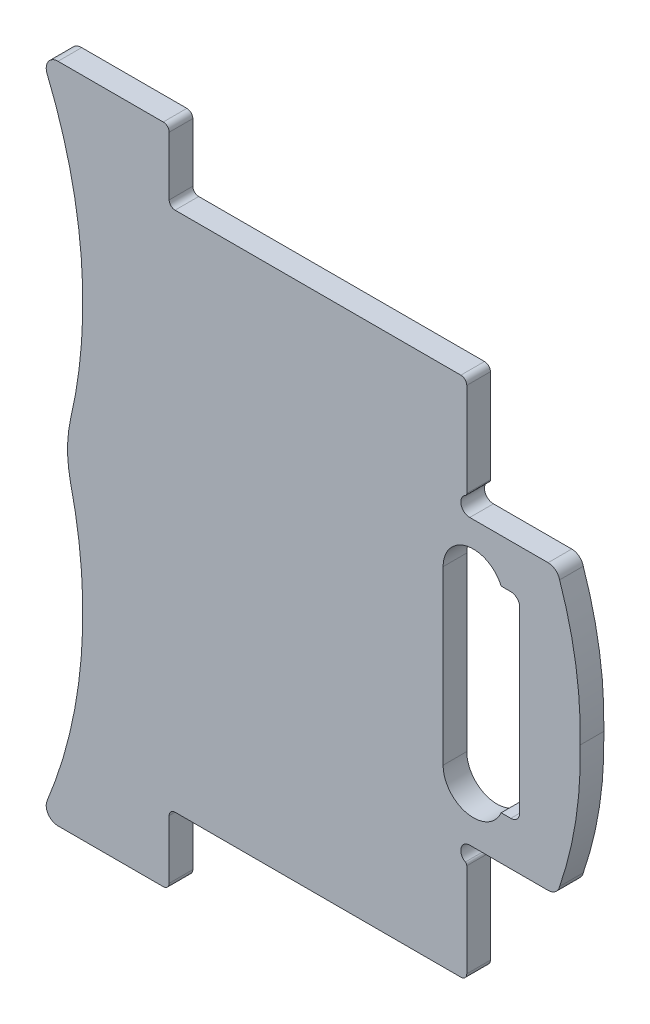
ISO-10303-21;
HEADER;
FILE_DESCRIPTION(('STEP AP214'),'2;1');
FILE_NAME('part.step','',(''),(''),'','','');
FILE_SCHEMA(('AUTOMOTIVE_DESIGN { 1 0 10303 214 1 1 1 1 }'));
ENDSEC;
DATA;
#1=APPLICATION_CONTEXT('core data for automotive mechanical design processes');
#2=APPLICATION_PROTOCOL_DEFINITION('international standard','automotive_design',2000,#1);
#3=PRODUCT_CONTEXT('',#1,'mechanical');
#4=PRODUCT('Part','Part','',(#3));
#5=PRODUCT_RELATED_PRODUCT_CATEGORY('part','',(#4));
#6=PRODUCT_DEFINITION_FORMATION('','',#4);
#7=PRODUCT_DEFINITION_CONTEXT('part definition',#1,'design');
#8=PRODUCT_DEFINITION('design','',#6,#7);
#9=PRODUCT_DEFINITION_SHAPE('','',#8);
#10=(LENGTH_UNIT() NAMED_UNIT(*) SI_UNIT(.MILLI.,.METRE.));
#11=(NAMED_UNIT(*) PLANE_ANGLE_UNIT() SI_UNIT($,.RADIAN.));
#12=(NAMED_UNIT(*) SI_UNIT($,.STERADIAN.) SOLID_ANGLE_UNIT());
#13=UNCERTAINTY_MEASURE_WITH_UNIT(LENGTH_MEASURE(1.E-05),#10,'distance_accuracy_value','');
#14=(GEOMETRIC_REPRESENTATION_CONTEXT(3) GLOBAL_UNCERTAINTY_ASSIGNED_CONTEXT((#13)) GLOBAL_UNIT_ASSIGNED_CONTEXT((#10,
#11,#12)) REPRESENTATION_CONTEXT('',''));
#15=CARTESIAN_POINT('',(0.,0.,0.));
#16=DIRECTION('',(0.,0.,1.));
#17=DIRECTION('',(1.,0.,0.));
#18=AXIS2_PLACEMENT_3D('',#15,#16,#17);
#19=CARTESIAN_POINT('',(109.223647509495,-74.0985462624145,12.7));
#20=DIRECTION('',(0.,0.,1.));
#21=DIRECTION('',(1.,0.,0.));
#22=AXIS2_PLACEMENT_3D('',#19,#20,#21);
#23=CYLINDRICAL_SURFACE('',#22,4.77520001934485);
#24=DIRECTION('',(0.,0.,1.));
#25=VECTOR('',#24,1.);
#26=CARTESIAN_POINT('',(113.99884752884,-74.0985462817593,12.7));
#27=LINE('',#26,#25);
#28=CARTESIAN_POINT('',(113.99884752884,-74.0985462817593,12.7));
#29=VERTEX_POINT('',#28);
#30=CARTESIAN_POINT('',(113.99884752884,-74.0985462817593,25.4));
#31=VERTEX_POINT('',#30);
#32=EDGE_CURVE('E12',#29,#31,#27,.T.);
#33=ORIENTED_EDGE('',*,*,#32,.F.);
#34=CARTESIAN_POINT('',(109.223647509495,-74.0985462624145,12.7));
#35=DIRECTION('',(0.,0.,1.));
#36=DIRECTION('',(-1.,0.,0.));
#37=AXIS2_PLACEMENT_3D('',#34,#35,#36);
#38=CIRCLE('',#37,4.77520001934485);
#39=CARTESIAN_POINT('',(109.223647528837,-78.8737462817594,12.7));
#40=VERTEX_POINT('',#39);
#41=EDGE_CURVE('E595',#40,#29,#38,.T.);
#42=ORIENTED_EDGE('',*,*,#41,.F.);
#43=DIRECTION('',(0.,0.,1.));
#44=VECTOR('',#43,1.);
#45=CARTESIAN_POINT('',(109.223647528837,-78.8737462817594,12.7));
#46=LINE('',#45,#44);
#47=CARTESIAN_POINT('',(109.223647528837,-78.8737462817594,25.4));
#48=VERTEX_POINT('',#47);
#49=EDGE_CURVE('E31',#40,#48,#46,.T.);
#50=ORIENTED_EDGE('',*,*,#49,.T.);
#51=CARTESIAN_POINT('',(109.223647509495,-74.0985462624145,25.4));
#52=DIRECTION('',(0.,0.,1.));
#53=DIRECTION('',(1.,0.,0.));
#54=AXIS2_PLACEMENT_3D('',#51,#52,#53);
#55=CIRCLE('',#54,4.77520001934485);
#56=EDGE_CURVE('E445',#48,#31,#55,.T.);
#57=ORIENTED_EDGE('',*,*,#56,.T.);
#58=EDGE_LOOP('',(#33,#42,#50,#57));
#59=FACE_BOUND('',#58,.T.);
#60=ADVANCED_FACE('F20',(#59),#23,.F.);
#61=CARTESIAN_POINT('',(109.223647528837,-78.8737462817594,12.7));
#62=DIRECTION('',(0.,1.,0.));
#63=DIRECTION('',(1.,0.,0.));
#64=AXIS2_PLACEMENT_3D('',#61,#62,#63);
#65=PLANE('',#64);
#66=ORIENTED_EDGE('',*,*,#49,.F.);
#67=DIRECTION('',(1.,0.,0.));
#68=VECTOR('',#67,1.);
#69=CARTESIAN_POINT('',(109.223647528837,-78.8737462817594,12.7));
#70=LINE('',#69,#68);
#71=CARTESIAN_POINT('',(104.042047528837,-78.8737462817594,12.7));
#72=VERTEX_POINT('',#71);
#73=EDGE_CURVE('E598',#72,#40,#70,.T.);
#74=ORIENTED_EDGE('',*,*,#73,.F.);
#75=DIRECTION('',(0.,0.,1.));
#76=VECTOR('',#75,1.);
#77=CARTESIAN_POINT('',(104.042047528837,-78.8737462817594,12.7));
#78=LINE('',#77,#76);
#79=CARTESIAN_POINT('',(104.042047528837,-78.8737462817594,25.4));
#80=VERTEX_POINT('',#79);
#81=EDGE_CURVE('E742',#72,#80,#78,.T.);
#82=ORIENTED_EDGE('',*,*,#81,.T.);
#83=DIRECTION('',(-1.,0.,0.));
#84=VECTOR('',#83,1.);
#85=CARTESIAN_POINT('',(-374.582985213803,-78.8737462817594,25.4));
#86=LINE('',#85,#84);
#87=EDGE_CURVE('E443',#80,#48,#86,.F.);
#88=ORIENTED_EDGE('',*,*,#87,.T.);
#89=EDGE_LOOP('',(#66,#74,#82,#88));
#90=FACE_BOUND('',#89,.T.);
#91=ADVANCED_FACE('F758',(#90),#65,.T.);
#92=CARTESIAN_POINT('',(89.1364645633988,-72.3911513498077,12.7));
#93=DIRECTION('',(0.,0.,1.));
#94=DIRECTION('',(1.,0.,0.));
#95=AXIS2_PLACEMENT_3D('',#92,#93,#94);
#96=CYLINDRICAL_SURFACE('',#95,16.2542437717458);
#97=ORIENTED_EDGE('',*,*,#81,.F.);
#98=CARTESIAN_POINT('',(89.1364645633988,-72.3911513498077,12.7));
#99=DIRECTION('',(0.,0.,1.));
#100=DIRECTION('',(-1.,0.,0.));
#101=AXIS2_PLACEMENT_3D('',#98,#99,#100);
#102=CIRCLE('',#101,16.2542437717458);
#103=CARTESIAN_POINT('',(72.8823144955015,-72.335959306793,12.7));
#104=VERTEX_POINT('',#103);
#105=EDGE_CURVE('E602',#104,#72,#102,.T.);
#106=ORIENTED_EDGE('',*,*,#105,.F.);
#107=DIRECTION('',(0.,0.,1.));
#108=VECTOR('',#107,1.);
#109=CARTESIAN_POINT('',(72.8823144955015,-72.335959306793,12.7));
#110=LINE('',#109,#108);
#111=CARTESIAN_POINT('',(72.8823144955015,-72.335959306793,25.4));
#112=VERTEX_POINT('',#111);
#113=EDGE_CURVE('E739',#104,#112,#110,.T.);
#114=ORIENTED_EDGE('',*,*,#113,.T.);
#115=CARTESIAN_POINT('',(89.1364645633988,-72.3911513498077,25.4));
#116=DIRECTION('',(0.,0.,1.));
#117=DIRECTION('',(1.,0.,0.));
#118=AXIS2_PLACEMENT_3D('',#115,#116,#117);
#119=CIRCLE('',#118,16.2542437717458);
#120=EDGE_CURVE('E438',#112,#80,#119,.T.);
#121=ORIENTED_EDGE('',*,*,#120,.T.);
#122=EDGE_LOOP('',(#97,#106,#114,#121));
#123=FACE_BOUND('',#122,.T.);
#124=ADVANCED_FACE('F761',(#123),#96,.F.);
#125=CARTESIAN_POINT('',(72.8823144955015,19.9984666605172,12.7));
#126=DIRECTION('',(1.,0.,0.));
#127=DIRECTION('',(0.,-1.,0.));
#128=AXIS2_PLACEMENT_3D('',#125,#126,#127);
#129=PLANE('',#128);
#130=ORIENTED_EDGE('',*,*,#113,.F.);
#131=DIRECTION('',(0.,-1.,0.));
#132=VECTOR('',#131,1.);
#133=CARTESIAN_POINT('',(72.8823144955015,19.9984666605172,12.7));
#134=LINE('',#133,#132);
#135=CARTESIAN_POINT('',(72.8823144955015,19.9984666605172,12.7));
#136=VERTEX_POINT('',#135);
#137=EDGE_CURVE('E606',#136,#104,#134,.T.);
#138=ORIENTED_EDGE('',*,*,#137,.F.);
#139=DIRECTION('',(0.,0.,1.));
#140=VECTOR('',#139,1.);
#141=CARTESIAN_POINT('',(72.8823144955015,19.9984666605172,12.7));
#142=LINE('',#141,#140);
#143=CARTESIAN_POINT('',(72.8823144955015,19.9984666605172,25.4));
#144=VERTEX_POINT('',#143);
#145=EDGE_CURVE('E737',#136,#144,#142,.T.);
#146=ORIENTED_EDGE('',*,*,#145,.T.);
#147=DIRECTION('',(0.,1.,0.));
#148=VECTOR('',#147,1.);
#149=CARTESIAN_POINT('',(72.8823144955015,-98.3607864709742,25.4));
#150=LINE('',#149,#148);
#151=EDGE_CURVE('E442',#144,#112,#150,.F.);
#152=ORIENTED_EDGE('',*,*,#151,.T.);
#153=EDGE_LOOP('',(#130,#138,#146,#152));
#154=FACE_BOUND('',#153,.T.);
#155=ADVANCED_FACE('F767',(#154),#129,.T.);
#156=CARTESIAN_POINT('',(89.1364645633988,20.0536587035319,12.7));
#157=DIRECTION('',(0.,0.,1.));
#158=DIRECTION('',(1.,0.,0.));
#159=AXIS2_PLACEMENT_3D('',#156,#157,#158);
#160=CYLINDRICAL_SURFACE('',#159,16.2542437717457);
#161=ORIENTED_EDGE('',*,*,#145,.F.);
#162=CARTESIAN_POINT('',(89.1364645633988,20.0536587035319,12.7));
#163=DIRECTION('',(0.,0.,1.));
#164=DIRECTION('',(1.,0.,0.));
#165=AXIS2_PLACEMENT_3D('',#162,#163,#164);
#166=CIRCLE('',#165,16.2542437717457);
#167=CARTESIAN_POINT('',(104.042047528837,26.5362536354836,12.7));
#168=VERTEX_POINT('',#167);
#169=EDGE_CURVE('E612',#168,#136,#166,.T.);
#170=ORIENTED_EDGE('',*,*,#169,.F.);
#171=DIRECTION('',(0.,0.,1.));
#172=VECTOR('',#171,1.);
#173=CARTESIAN_POINT('',(104.042047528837,26.5362536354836,12.7));
#174=LINE('',#173,#172);
#175=CARTESIAN_POINT('',(104.042047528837,26.5362536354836,25.4));
#176=VERTEX_POINT('',#175);
#177=EDGE_CURVE('E171',#168,#176,#174,.T.);
#178=ORIENTED_EDGE('',*,*,#177,.T.);
#179=CARTESIAN_POINT('',(89.1364645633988,20.0536587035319,25.4));
#180=DIRECTION('',(0.,0.,1.));
#181=DIRECTION('',(1.,0.,0.));
#182=AXIS2_PLACEMENT_3D('',#179,#180,#181);
#183=CIRCLE('',#182,16.2542437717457);
#184=EDGE_CURVE('E426',#176,#144,#183,.T.);
#185=ORIENTED_EDGE('',*,*,#184,.T.);
#186=EDGE_LOOP('',(#161,#170,#178,#185));
#187=FACE_BOUND('',#186,.T.);
#188=ADVANCED_FACE('F774',(#187),#160,.F.);
#189=CARTESIAN_POINT('',(109.223647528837,26.5362536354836,12.7));
#190=DIRECTION('',(0.,-1.,0.));
#191=DIRECTION('',(-1.,0.,0.));
#192=AXIS2_PLACEMENT_3D('',#189,#190,#191);
#193=PLANE('',#192);
#194=ORIENTED_EDGE('',*,*,#177,.F.);
#195=DIRECTION('',(-1.,0.,0.));
#196=VECTOR('',#195,1.);
#197=CARTESIAN_POINT('',(109.223647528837,26.5362536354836,12.7));
#198=LINE('',#197,#196);
#199=CARTESIAN_POINT('',(109.223647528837,26.5362536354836,12.7));
#200=VERTEX_POINT('',#199);
#201=EDGE_CURVE('E285',#200,#168,#198,.T.);
#202=ORIENTED_EDGE('',*,*,#201,.F.);
#203=DIRECTION('',(0.,0.,1.));
#204=VECTOR('',#203,1.);
#205=CARTESIAN_POINT('',(109.223647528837,26.5362536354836,12.7));
#206=LINE('',#205,#204);
#207=CARTESIAN_POINT('',(109.223647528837,26.5362536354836,25.4));
#208=VERTEX_POINT('',#207);
#209=EDGE_CURVE('E39',#200,#208,#206,.T.);
#210=ORIENTED_EDGE('',*,*,#209,.T.);
#211=DIRECTION('',(-1.,0.,0.));
#212=VECTOR('',#211,1.);
#213=CARTESIAN_POINT('',(-374.582985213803,26.5362536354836,25.4));
#214=LINE('',#213,#212);
#215=EDGE_CURVE('E423',#208,#176,#214,.T.);
#216=ORIENTED_EDGE('',*,*,#215,.T.);
#217=EDGE_LOOP('',(#194,#202,#210,#216));
#218=FACE_BOUND('',#217,.T.);
#219=ADVANCED_FACE('F776',(#218),#193,.T.);
#220=CARTESIAN_POINT('',(109.223647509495,21.7610536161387,12.7));
#221=DIRECTION('',(0.,0.,1.));
#222=DIRECTION('',(1.,0.,0.));
#223=AXIS2_PLACEMENT_3D('',#220,#221,#222);
#224=CYLINDRICAL_SURFACE('',#223,4.77520001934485);
#225=ORIENTED_EDGE('',*,*,#209,.F.);
#226=CARTESIAN_POINT('',(109.223647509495,21.7610536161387,12.7));
#227=DIRECTION('',(0.,0.,1.));
#228=DIRECTION('',(1.,0.,0.));
#229=AXIS2_PLACEMENT_3D('',#226,#227,#228);
#230=CIRCLE('',#229,4.77520001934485);
#231=CARTESIAN_POINT('',(113.99884752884,21.7610536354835,12.7));
#232=VERTEX_POINT('',#231);
#233=EDGE_CURVE('E584',#232,#200,#230,.T.);
#234=ORIENTED_EDGE('',*,*,#233,.F.);
#235=DIRECTION('',(0.,0.,1.));
#236=VECTOR('',#235,1.);
#237=CARTESIAN_POINT('',(113.99884752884,21.7610536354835,12.7));
#238=LINE('',#237,#236);
#239=CARTESIAN_POINT('',(113.99884752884,21.7610536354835,25.4));
#240=VERTEX_POINT('',#239);
#241=EDGE_CURVE('E24',#232,#240,#238,.T.);
#242=ORIENTED_EDGE('',*,*,#241,.T.);
#243=CARTESIAN_POINT('',(109.223647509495,21.7610536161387,25.4));
#244=DIRECTION('',(0.,0.,1.));
#245=DIRECTION('',(1.,0.,0.));
#246=AXIS2_PLACEMENT_3D('',#243,#244,#245);
#247=CIRCLE('',#246,4.77520001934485);
#248=EDGE_CURVE('E293',#240,#208,#247,.T.);
#249=ORIENTED_EDGE('',*,*,#248,.T.);
#250=EDGE_LOOP('',(#225,#234,#242,#249));
#251=FACE_BOUND('',#250,.T.);
#252=ADVANCED_FACE('F778',(#251),#224,.F.);
#253=CARTESIAN_POINT('',(-77.4017349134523,-203.968746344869,12.7));
#254=DIRECTION('',(0.,1.,0.));
#255=DIRECTION('',(1.,0.,0.));
#256=AXIS2_PLACEMENT_3D('',#253,#254,#255);
#257=PLANE('',#256);
#258=DIRECTION('',(0.,0.,1.));
#259=VECTOR('',#258,1.);
#260=CARTESIAN_POINT('',(-133.896948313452,-203.968746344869,12.7));
#261=LINE('',#260,#259);
#262=CARTESIAN_POINT('',(-133.896948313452,-203.968746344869,12.7));
#263=VERTEX_POINT('',#262);
#264=CARTESIAN_POINT('',(-133.896948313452,-203.968746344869,25.4));
#265=VERTEX_POINT('',#264);
#266=EDGE_CURVE('E188',#263,#265,#261,.T.);
#267=ORIENTED_EDGE('',*,*,#266,.F.);
#268=DIRECTION('',(1.,0.,0.));
#269=VECTOR('',#268,1.);
#270=CARTESIAN_POINT('',(-77.4017349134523,-203.968746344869,12.7));
#271=LINE('',#270,#269);
#272=CARTESIAN_POINT('',(-77.4017349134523,-203.968746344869,12.7));
#273=VERTEX_POINT('',#272);
#274=EDGE_CURVE('E457',#263,#273,#271,.T.);
#275=ORIENTED_EDGE('',*,*,#274,.T.);
#276=DIRECTION('',(0.,0.,1.));
#277=VECTOR('',#276,1.);
#278=CARTESIAN_POINT('',(-77.4017349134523,-203.968746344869,12.7));
#279=LINE('',#278,#277);
#280=CARTESIAN_POINT('',(-77.4017349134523,-203.968746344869,25.4));
#281=VERTEX_POINT('',#280);
#282=EDGE_CURVE('E722',#273,#281,#279,.T.);
#283=ORIENTED_EDGE('',*,*,#282,.T.);
#284=DIRECTION('',(-1.,0.,0.));
#285=VECTOR('',#284,1.);
#286=CARTESIAN_POINT('',(-374.582985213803,-203.968746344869,25.4));
#287=LINE('',#286,#285);
#288=EDGE_CURVE('E415',#265,#281,#287,.F.);
#289=ORIENTED_EDGE('',*,*,#288,.F.);
#290=EDGE_LOOP('',(#267,#275,#283,#289));
#291=FACE_BOUND('',#290,.T.);
#292=ADVANCED_FACE('F785',(#291),#257,.F.);
#293=CARTESIAN_POINT('',(-77.4017348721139,-200.793746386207,12.7));
#294=DIRECTION('',(0.,0.,1.));
#295=DIRECTION('',(1.,0.,0.));
#296=AXIS2_PLACEMENT_3D('',#293,#294,#295);
#297=CYLINDRICAL_SURFACE('',#296,3.17499995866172);
#298=ORIENTED_EDGE('',*,*,#282,.F.);
#299=CARTESIAN_POINT('',(-77.4017348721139,-200.793746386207,12.7));
#300=DIRECTION('',(0.,0.,1.));
#301=DIRECTION('',(-1.,0.,0.));
#302=AXIS2_PLACEMENT_3D('',#299,#300,#301);
#303=CIRCLE('',#302,3.17499995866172);
#304=CARTESIAN_POINT('',(-74.2267349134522,-200.793746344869,12.7));
#305=VERTEX_POINT('',#304);
#306=EDGE_CURVE('E465',#273,#305,#303,.T.);
#307=ORIENTED_EDGE('',*,*,#306,.T.);
#308=DIRECTION('',(0.,0.,1.));
#309=VECTOR('',#308,1.);
#310=CARTESIAN_POINT('',(-74.2267349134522,-200.793746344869,12.7));
#311=LINE('',#310,#309);
#312=CARTESIAN_POINT('',(-74.2267349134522,-200.793746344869,25.4));
#313=VERTEX_POINT('',#312);
#314=EDGE_CURVE('E714',#305,#313,#311,.T.);
#315=ORIENTED_EDGE('',*,*,#314,.T.);
#316=CARTESIAN_POINT('',(-77.4017348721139,-200.793746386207,25.4));
#317=DIRECTION('',(0.,0.,1.));
#318=DIRECTION('',(1.,0.,0.));
#319=AXIS2_PLACEMENT_3D('',#316,#317,#318);
#320=CIRCLE('',#319,3.17499995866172);
#321=EDGE_CURVE('E411',#281,#313,#320,.T.);
#322=ORIENTED_EDGE('',*,*,#321,.F.);
#323=EDGE_LOOP('',(#298,#307,#315,#322));
#324=FACE_BOUND('',#323,.T.);
#325=ADVANCED_FACE('F829',(#324),#297,.T.);
#326=CARTESIAN_POINT('',(-74.2267349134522,-169.329496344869,12.7));
#327=DIRECTION('',(-1.,0.,0.));
#328=DIRECTION('',(0.,1.,0.));
#329=AXIS2_PLACEMENT_3D('',#326,#327,#328);
#330=PLANE('',#329);
#331=ORIENTED_EDGE('',*,*,#314,.F.);
#332=DIRECTION('',(0.,1.,0.));
#333=VECTOR('',#332,1.);
#334=CARTESIAN_POINT('',(-74.2267349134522,-169.329496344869,12.7));
#335=LINE('',#334,#333);
#336=CARTESIAN_POINT('',(-74.2267349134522,-169.329496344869,12.7));
#337=VERTEX_POINT('',#336);
#338=EDGE_CURVE('E468',#305,#337,#335,.T.);
#339=ORIENTED_EDGE('',*,*,#338,.T.);
#340=DIRECTION('',(0.,0.,1.));
#341=VECTOR('',#340,1.);
#342=CARTESIAN_POINT('',(-74.2267349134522,-169.329496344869,12.7));
#343=LINE('',#342,#341);
#344=CARTESIAN_POINT('',(-74.2267349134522,-169.329496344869,25.4));
#345=VERTEX_POINT('',#344);
#346=EDGE_CURVE('E711',#337,#345,#343,.T.);
#347=ORIENTED_EDGE('',*,*,#346,.T.);
#348=DIRECTION('',(0.,1.,0.));
#349=VECTOR('',#348,1.);
#350=CARTESIAN_POINT('',(-74.2267349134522,-98.3607864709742,25.4));
#351=LINE('',#350,#349);
#352=EDGE_CURVE('E407',#313,#345,#351,.T.);
#353=ORIENTED_EDGE('',*,*,#352,.F.);
#354=EDGE_LOOP('',(#331,#339,#347,#353));
#355=FACE_BOUND('',#354,.T.);
#356=ADVANCED_FACE('F839',(#355),#330,.F.);
#357=CARTESIAN_POINT('',(-71.0517349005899,-169.329496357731,12.7));
#358=DIRECTION('',(0.,0.,-1.));
#359=DIRECTION('',(-1.,0.,0.));
#360=AXIS2_PLACEMENT_3D('',#357,#358,#359);
#361=CYLINDRICAL_SURFACE('',#360,3.17500001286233);
#362=ORIENTED_EDGE('',*,*,#346,.F.);
#363=CARTESIAN_POINT('',(-71.0517349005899,-169.329496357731,12.7));
#364=DIRECTION('',(0.,0.,-1.));
#365=DIRECTION('',(-1.,0.,0.));
#366=AXIS2_PLACEMENT_3D('',#363,#364,#365);
#367=CIRCLE('',#366,3.17500001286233);
#368=CARTESIAN_POINT('',(-71.0517349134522,-166.154496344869,12.7));
#369=VERTEX_POINT('',#368);
#370=EDGE_CURVE('E472',#337,#369,#367,.T.);
#371=ORIENTED_EDGE('',*,*,#370,.T.);
#372=DIRECTION('',(0.,0.,1.));
#373=VECTOR('',#372,1.);
#374=CARTESIAN_POINT('',(-71.0517349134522,-166.154496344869,12.7));
#375=LINE('',#374,#373);
#376=CARTESIAN_POINT('',(-71.0517349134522,-166.154496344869,25.4));
#377=VERTEX_POINT('',#376);
#378=EDGE_CURVE('E708',#369,#377,#375,.T.);
#379=ORIENTED_EDGE('',*,*,#378,.T.);
#380=CARTESIAN_POINT('',(-71.0517349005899,-169.329496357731,25.4));
#381=DIRECTION('',(0.,0.,-1.));
#382=DIRECTION('',(-1.,0.,0.));
#383=AXIS2_PLACEMENT_3D('',#380,#381,#382);
#384=CIRCLE('',#383,3.17500001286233);
#385=EDGE_CURVE('E403',#345,#377,#384,.T.);
#386=ORIENTED_EDGE('',*,*,#385,.F.);
#387=EDGE_LOOP('',(#362,#371,#379,#386));
#388=FACE_BOUND('',#387,.T.);
#389=ADVANCED_FACE('F849',(#388),#361,.F.);
#390=CARTESIAN_POINT('',(82.4105184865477,-166.154496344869,12.7));
#391=DIRECTION('',(0.,1.,0.));
#392=DIRECTION('',(1.,0.,0.));
#393=AXIS2_PLACEMENT_3D('',#390,#391,#392);
#394=PLANE('',#393);
#395=ORIENTED_EDGE('',*,*,#378,.F.);
#396=DIRECTION('',(1.,0.,0.));
#397=VECTOR('',#396,1.);
#398=CARTESIAN_POINT('',(82.4105184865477,-166.154496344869,12.7));
#399=LINE('',#398,#397);
#400=CARTESIAN_POINT('',(82.4105184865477,-166.154496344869,12.7));
#401=VERTEX_POINT('',#400);
#402=EDGE_CURVE('E476',#369,#401,#399,.T.);
#403=ORIENTED_EDGE('',*,*,#402,.T.);
#404=DIRECTION('',(0.,0.,1.));
#405=VECTOR('',#404,1.);
#406=CARTESIAN_POINT('',(82.4105184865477,-166.154496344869,12.7));
#407=LINE('',#406,#405);
#408=CARTESIAN_POINT('',(82.4105184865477,-166.154496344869,25.4));
#409=VERTEX_POINT('',#408);
#410=EDGE_CURVE('E706',#401,#409,#407,.T.);
#411=ORIENTED_EDGE('',*,*,#410,.T.);
#412=DIRECTION('',(-1.,0.,0.));
#413=VECTOR('',#412,1.);
#414=CARTESIAN_POINT('',(-374.582985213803,-166.154496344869,25.4));
#415=LINE('',#414,#413);
#416=EDGE_CURVE('E406',#377,#409,#415,.F.);
#417=ORIENTED_EDGE('',*,*,#416,.F.);
#418=EDGE_LOOP('',(#395,#403,#411,#417));
#419=FACE_BOUND('',#418,.T.);
#420=ADVANCED_FACE('F859',(#419),#394,.F.);
#421=CARTESIAN_POINT('',(82.4105184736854,-162.979496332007,12.7));
#422=DIRECTION('',(0.,0.,1.));
#423=DIRECTION('',(1.,0.,0.));
#424=AXIS2_PLACEMENT_3D('',#421,#422,#423);
#425=CYLINDRICAL_SURFACE('',#424,3.1750000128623);
#426=ORIENTED_EDGE('',*,*,#410,.F.);
#427=CARTESIAN_POINT('',(82.4105184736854,-162.979496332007,12.7));
#428=DIRECTION('',(0.,0.,1.));
#429=DIRECTION('',(-1.,0.,0.));
#430=AXIS2_PLACEMENT_3D('',#427,#428,#429);
#431=CIRCLE('',#430,3.1750000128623);
#432=CARTESIAN_POINT('',(85.5855184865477,-162.979496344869,12.7));
#433=VERTEX_POINT('',#432);
#434=EDGE_CURVE('E484',#401,#433,#431,.T.);
#435=ORIENTED_EDGE('',*,*,#434,.T.);
#436=DIRECTION('',(0.,0.,1.));
#437=VECTOR('',#436,1.);
#438=CARTESIAN_POINT('',(85.5855184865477,-162.979496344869,12.7));
#439=LINE('',#438,#437);
#440=CARTESIAN_POINT('',(85.5855184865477,-162.979496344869,25.4));
#441=VERTEX_POINT('',#440);
#442=EDGE_CURVE('E698',#433,#441,#439,.T.);
#443=ORIENTED_EDGE('',*,*,#442,.T.);
#444=CARTESIAN_POINT('',(82.4105184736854,-162.979496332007,25.4));
#445=DIRECTION('',(0.,0.,1.));
#446=DIRECTION('',(1.,0.,0.));
#447=AXIS2_PLACEMENT_3D('',#444,#445,#446);
#448=CIRCLE('',#447,3.1750000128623);
#449=EDGE_CURVE('E394',#409,#441,#448,.T.);
#450=ORIENTED_EDGE('',*,*,#449,.F.);
#451=EDGE_LOOP('',(#426,#435,#443,#450));
#452=FACE_BOUND('',#451,.T.);
#453=ADVANCED_FACE('F869',(#452),#425,.T.);
#454=CARTESIAN_POINT('',(85.5854930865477,-112.752672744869,12.7));
#455=DIRECTION('',(-0.999999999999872,-5.0570587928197E-07,0.));
#456=DIRECTION('',(-5.0570587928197E-07,0.999999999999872,0.));
#457=AXIS2_PLACEMENT_3D('',#454,#455,#456);
#458=PLANE('',#457);
#459=ORIENTED_EDGE('',*,*,#442,.F.);
#460=DIRECTION('',(-5.0570587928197E-07,0.999999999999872,0.));
#461=VECTOR('',#460,1.);
#462=CARTESIAN_POINT('',(85.5854930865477,-112.752672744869,12.7));
#463=LINE('',#462,#461);
#464=CARTESIAN_POINT('',(85.5854930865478,-112.752672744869,12.7));
#465=VERTEX_POINT('',#464);
#466=EDGE_CURVE('E487',#433,#465,#463,.T.);
#467=ORIENTED_EDGE('',*,*,#466,.T.);
#468=DIRECTION('',(0.,0.,1.));
#469=VECTOR('',#468,1.);
#470=CARTESIAN_POINT('',(85.5854930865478,-112.752672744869,12.7));
#471=LINE('',#470,#469);
#472=CARTESIAN_POINT('',(85.5854930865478,-112.752672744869,25.4));
#473=VERTEX_POINT('',#472);
#474=EDGE_CURVE('E695',#465,#473,#471,.T.);
#475=ORIENTED_EDGE('',*,*,#474,.T.);
#476=DIRECTION('',(-5.0570587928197E-07,0.999999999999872,0.));
#477=VECTOR('',#476,1.);
#478=CARTESIAN_POINT('',(85.5854930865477,-112.752672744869,25.4));
#479=LINE('',#478,#477);
#480=EDGE_CURVE('E390',#441,#473,#479,.T.);
#481=ORIENTED_EDGE('',*,*,#480,.F.);
#482=EDGE_LOOP('',(#459,#467,#475,#481));
#483=FACE_BOUND('',#482,.T.);
#484=ADVANCED_FACE('F879',(#483),#458,.F.);
#485=CARTESIAN_POINT('',(83.9979835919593,-112.752667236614,12.7));
#486=DIRECTION('',(0.,0.,1.));
#487=DIRECTION('',(1.,0.,0.));
#488=AXIS2_PLACEMENT_3D('',#485,#486,#487);
#489=CYLINDRICAL_SURFACE('',#488,1.58750949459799);
#490=ORIENTED_EDGE('',*,*,#474,.F.);
#491=CARTESIAN_POINT('',(83.9979835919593,-112.752667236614,12.7));
#492=DIRECTION('',(0.,0.,1.));
#493=DIRECTION('',(-1.,0.,0.));
#494=AXIS2_PLACEMENT_3D('',#491,#492,#493);
#495=CIRCLE('',#494,1.58750949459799);
#496=CARTESIAN_POINT('',(84.7901713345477,-111.376940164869,12.7));
#497=VERTEX_POINT('',#496);
#498=EDGE_CURVE('E491',#465,#497,#495,.T.);
#499=ORIENTED_EDGE('',*,*,#498,.T.);
#500=DIRECTION('',(0.,0.,1.));
#501=VECTOR('',#500,1.);
#502=CARTESIAN_POINT('',(84.7901713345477,-111.376940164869,12.7));
#503=LINE('',#502,#501);
#504=CARTESIAN_POINT('',(84.7901713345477,-111.376940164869,25.4));
#505=VERTEX_POINT('',#504);
#506=EDGE_CURVE('E692',#497,#505,#503,.T.);
#507=ORIENTED_EDGE('',*,*,#506,.T.);
#508=CARTESIAN_POINT('',(83.9979835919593,-112.752667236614,25.4));
#509=DIRECTION('',(0.,0.,1.));
#510=DIRECTION('',(1.,0.,0.));
#511=AXIS2_PLACEMENT_3D('',#508,#509,#510);
#512=CIRCLE('',#511,1.58750949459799);
#513=EDGE_CURVE('E386',#473,#505,#512,.T.);
#514=ORIENTED_EDGE('',*,*,#513,.F.);
#515=EDGE_LOOP('',(#490,#499,#507,#514));
#516=FACE_BOUND('',#515,.T.);
#517=ADVANCED_FACE('F889',(#516),#489,.T.);
#518=CARTESIAN_POINT('',(87.1983931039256,-107.194746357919,12.7));
#519=DIRECTION('',(0.,0.,-1.));
#520=DIRECTION('',(-1.,0.,0.));
#521=AXIS2_PLACEMENT_3D('',#518,#519,#520);
#522=CYLINDRICAL_SURFACE('',#521,4.82600011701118);
#523=ORIENTED_EDGE('',*,*,#506,.F.);
#524=CARTESIAN_POINT('',(87.1983931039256,-107.194746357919,12.7));
#525=DIRECTION('',(0.,0.,-1.));
#526=DIRECTION('',(-1.,0.,0.));
#527=AXIS2_PLACEMENT_3D('',#524,#525,#526);
#528=CIRCLE('',#527,4.82600011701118);
#529=CARTESIAN_POINT('',(87.1983936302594,-102.368746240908,12.7));
#530=VERTEX_POINT('',#529);
#531=EDGE_CURVE('E495',#497,#530,#528,.T.);
#532=ORIENTED_EDGE('',*,*,#531,.T.);
#533=DIRECTION('',(0.,0.,1.));
#534=VECTOR('',#533,1.);
#535=CARTESIAN_POINT('',(87.1983936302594,-102.368746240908,12.7));
#536=LINE('',#535,#534);
#537=CARTESIAN_POINT('',(87.1983936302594,-102.368746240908,25.4));
#538=VERTEX_POINT('',#537);
#539=EDGE_CURVE('E690',#530,#538,#536,.T.);
#540=ORIENTED_EDGE('',*,*,#539,.T.);
#541=CARTESIAN_POINT('',(87.1983931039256,-107.194746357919,25.4));
#542=DIRECTION('',(0.,0.,-1.));
#543=DIRECTION('',(-1.,0.,0.));
#544=AXIS2_PLACEMENT_3D('',#541,#542,#543);
#545=CIRCLE('',#544,4.82600011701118);
#546=EDGE_CURVE('E383',#505,#538,#545,.T.);
#547=ORIENTED_EDGE('',*,*,#546,.F.);
#548=EDGE_LOOP('',(#523,#532,#540,#547));
#549=FACE_BOUND('',#548,.T.);
#550=ADVANCED_FACE('F899',(#549),#522,.F.);
#551=CARTESIAN_POINT('',(129.251649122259,-102.368746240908,12.7));
#552=DIRECTION('',(0.,1.,0.));
#553=DIRECTION('',(1.,0.,0.));
#554=AXIS2_PLACEMENT_3D('',#551,#552,#553);
#555=PLANE('',#554);
#556=ORIENTED_EDGE('',*,*,#539,.F.);
#557=DIRECTION('',(1.,0.,0.));
#558=VECTOR('',#557,1.);
#559=CARTESIAN_POINT('',(129.251649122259,-102.368746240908,12.7));
#560=LINE('',#559,#558);
#561=CARTESIAN_POINT('',(129.251649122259,-102.368746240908,12.7));
#562=VERTEX_POINT('',#561);
#563=EDGE_CURVE('E503',#530,#562,#560,.T.);
#564=ORIENTED_EDGE('',*,*,#563,.T.);
#565=DIRECTION('',(0.,0.,1.));
#566=VECTOR('',#565,1.);
#567=CARTESIAN_POINT('',(129.251649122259,-102.368746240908,12.7));
#568=LINE('',#567,#566);
#569=CARTESIAN_POINT('',(129.251649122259,-102.368746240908,25.4));
#570=VERTEX_POINT('',#569);
#571=EDGE_CURVE('E682',#562,#570,#568,.T.);
#572=ORIENTED_EDGE('',*,*,#571,.T.);
#573=DIRECTION('',(-1.,0.,0.));
#574=VECTOR('',#573,1.);
#575=CARTESIAN_POINT('',(-374.582985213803,-102.368746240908,25.4));
#576=LINE('',#575,#574);
#577=EDGE_CURVE('E377',#538,#570,#576,.F.);
#578=ORIENTED_EDGE('',*,*,#577,.F.);
#579=EDGE_LOOP('',(#556,#564,#572,#578));
#580=FACE_BOUND('',#579,.T.);
#581=ADVANCED_FACE('F909',(#580),#555,.F.);
#582=CARTESIAN_POINT('',(129.251839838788,-96.0185065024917,12.7));
#583=DIRECTION('',(0.,0.,1.));
#584=DIRECTION('',(1.,0.,0.));
#585=AXIS2_PLACEMENT_3D('',#582,#583,#584);
#586=CYLINDRICAL_SURFACE('',#585,6.35023974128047);
#587=ORIENTED_EDGE('',*,*,#571,.F.);
#588=CARTESIAN_POINT('',(129.251839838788,-96.0185065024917,12.7));
#589=DIRECTION('',(0.,0.,1.));
#590=DIRECTION('',(-1.,0.,0.));
#591=AXIS2_PLACEMENT_3D('',#588,#589,#590);
#592=CIRCLE('',#591,6.35023974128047);
#593=CARTESIAN_POINT('',(135.438023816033,-97.4526168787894,12.7));
#594=VERTEX_POINT('',#593);
#595=EDGE_CURVE('E506',#562,#594,#592,.T.);
#596=ORIENTED_EDGE('',*,*,#595,.T.);
#597=DIRECTION('',(0.,0.,1.));
#598=VECTOR('',#597,1.);
#599=CARTESIAN_POINT('',(135.438023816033,-97.4526168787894,12.7));
#600=LINE('',#599,#598);
#601=CARTESIAN_POINT('',(135.438023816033,-97.4526168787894,25.4));
#602=VERTEX_POINT('',#601);
#603=EDGE_CURVE('E679',#594,#602,#600,.T.);
#604=ORIENTED_EDGE('',*,*,#603,.T.);
#605=CARTESIAN_POINT('',(129.251839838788,-96.0185065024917,25.4));
#606=DIRECTION('',(0.,0.,1.));
#607=DIRECTION('',(1.,0.,0.));
#608=AXIS2_PLACEMENT_3D('',#605,#606,#607);
#609=CIRCLE('',#608,6.35023974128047);
#610=EDGE_CURVE('E373',#570,#602,#609,.T.);
#611=ORIENTED_EDGE('',*,*,#610,.F.);
#612=EDGE_LOOP('',(#587,#596,#604,#611));
#613=FACE_BOUND('',#612,.T.);
#614=ADVANCED_FACE('F919',(#613),#586,.T.);
#615=CARTESIAN_POINT('',(-56.6739993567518,-31.2467873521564,12.7));
#616=DIRECTION('',(0.,0.,1.));
#617=DIRECTION('',(1.,0.,0.));
#618=AXIS2_PLACEMENT_3D('',#615,#616,#617);
#619=CYLINDRICAL_SURFACE('',#618,203.200003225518);
#620=ORIENTED_EDGE('',*,*,#603,.F.);
#621=CARTESIAN_POINT('',(-56.6739993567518,-31.2467873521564,12.7));
#622=DIRECTION('',(0.,0.,1.));
#623=DIRECTION('',(-1.,0.,0.));
#624=AXIS2_PLACEMENT_3D('',#621,#622,#623);
#625=CIRCLE('',#624,203.200003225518);
#626=CARTESIAN_POINT('',(146.462542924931,-26.1687463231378,12.7));
#627=VERTEX_POINT('',#626);
#628=EDGE_CURVE('E510',#594,#627,#625,.T.);
#629=ORIENTED_EDGE('',*,*,#628,.T.);
#630=DIRECTION('',(0.,0.,1.));
#631=VECTOR('',#630,1.);
#632=CARTESIAN_POINT('',(146.462542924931,-26.1687463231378,12.7));
#633=LINE('',#632,#631);
#634=CARTESIAN_POINT('',(146.462542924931,-26.1687463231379,25.4));
#635=VERTEX_POINT('',#634);
#636=EDGE_CURVE('E676',#627,#635,#633,.T.);
#637=ORIENTED_EDGE('',*,*,#636,.T.);
#638=CARTESIAN_POINT('',(-56.6739993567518,-31.2467873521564,25.4));
#639=DIRECTION('',(0.,0.,1.));
#640=DIRECTION('',(1.,0.,0.));
#641=AXIS2_PLACEMENT_3D('',#638,#639,#640);
#642=CIRCLE('',#641,203.200003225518);
#643=EDGE_CURVE('E369',#602,#635,#642,.T.);
#644=ORIENTED_EDGE('',*,*,#643,.F.);
#645=EDGE_LOOP('',(#620,#629,#637,#644));
#646=FACE_BOUND('',#645,.T.);
#647=ADVANCED_FACE('F929',(#646),#619,.T.);
#648=CARTESIAN_POINT('',(-56.6739993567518,-21.0907052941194,12.7));
#649=DIRECTION('',(0.,0.,1.));
#650=DIRECTION('',(1.,0.,0.));
#651=AXIS2_PLACEMENT_3D('',#648,#649,#650);
#652=CYLINDRICAL_SURFACE('',#651,203.200003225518);
#653=ORIENTED_EDGE('',*,*,#636,.F.);
#654=CARTESIAN_POINT('',(-56.6739993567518,-21.0907052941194,12.7));
#655=DIRECTION('',(0.,0.,1.));
#656=DIRECTION('',(1.,0.,0.));
#657=AXIS2_PLACEMENT_3D('',#654,#655,#656);
#658=CIRCLE('',#657,203.200003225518);
#659=CARTESIAN_POINT('',(135.438023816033,45.1151242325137,12.7));
#660=VERTEX_POINT('',#659);
#661=EDGE_CURVE('E514',#627,#660,#658,.T.);
#662=ORIENTED_EDGE('',*,*,#661,.T.);
#663=DIRECTION('',(0.,0.,1.));
#664=VECTOR('',#663,1.);
#665=CARTESIAN_POINT('',(135.438023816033,45.1151242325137,12.7));
#666=LINE('',#665,#664);
#667=CARTESIAN_POINT('',(135.438023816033,45.1151242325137,25.4));
#668=VERTEX_POINT('',#667);
#669=EDGE_CURVE('E674',#660,#668,#666,.T.);
#670=ORIENTED_EDGE('',*,*,#669,.T.);
#671=CARTESIAN_POINT('',(-56.6739993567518,-21.0907052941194,25.4));
#672=DIRECTION('',(0.,0.,1.));
#673=DIRECTION('',(1.,0.,0.));
#674=AXIS2_PLACEMENT_3D('',#671,#672,#673);
#675=CIRCLE('',#674,203.200003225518);
#676=EDGE_CURVE('E366',#635,#668,#675,.T.);
#677=ORIENTED_EDGE('',*,*,#676,.F.);
#678=EDGE_LOOP('',(#653,#662,#670,#677));
#679=FACE_BOUND('',#678,.T.);
#680=ADVANCED_FACE('F939',(#679),#652,.T.);
#681=CARTESIAN_POINT('',(129.251839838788,43.6810138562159,12.7));
#682=DIRECTION('',(0.,0.,1.));
#683=DIRECTION('',(1.,0.,0.));
#684=AXIS2_PLACEMENT_3D('',#681,#682,#683);
#685=CYLINDRICAL_SURFACE('',#684,6.35023974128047);
#686=ORIENTED_EDGE('',*,*,#669,.F.);
#687=CARTESIAN_POINT('',(129.251839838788,43.6810138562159,12.7));
#688=DIRECTION('',(0.,0.,1.));
#689=DIRECTION('',(1.,0.,0.));
#690=AXIS2_PLACEMENT_3D('',#687,#688,#689);
#691=CIRCLE('',#690,6.35023974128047);
#692=CARTESIAN_POINT('',(129.251649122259,50.0312535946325,12.7));
#693=VERTEX_POINT('',#692);
#694=EDGE_CURVE('E522',#660,#693,#691,.T.);
#695=ORIENTED_EDGE('',*,*,#694,.T.);
#696=DIRECTION('',(0.,0.,1.));
#697=VECTOR('',#696,1.);
#698=CARTESIAN_POINT('',(129.251649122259,50.0312535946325,12.7));
#699=LINE('',#698,#697);
#700=CARTESIAN_POINT('',(129.251649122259,50.0312535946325,25.4));
#701=VERTEX_POINT('',#700);
#702=EDGE_CURVE('E666',#693,#701,#699,.T.);
#703=ORIENTED_EDGE('',*,*,#702,.T.);
#704=CARTESIAN_POINT('',(129.251839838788,43.6810138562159,25.4));
#705=DIRECTION('',(0.,0.,1.));
#706=DIRECTION('',(1.,0.,0.));
#707=AXIS2_PLACEMENT_3D('',#704,#705,#706);
#708=CIRCLE('',#707,6.35023974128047);
#709=EDGE_CURVE('E358',#668,#701,#708,.T.);
#710=ORIENTED_EDGE('',*,*,#709,.F.);
#711=EDGE_LOOP('',(#686,#695,#703,#710));
#712=FACE_BOUND('',#711,.T.);
#713=ADVANCED_FACE('F949',(#712),#685,.T.);
#714=CARTESIAN_POINT('',(129.251649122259,50.0312535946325,12.7));
#715=DIRECTION('',(0.,-1.,0.));
#716=DIRECTION('',(-1.,0.,0.));
#717=AXIS2_PLACEMENT_3D('',#714,#715,#716);
#718=PLANE('',#717);
#719=ORIENTED_EDGE('',*,*,#702,.F.);
#720=DIRECTION('',(-1.,0.,0.));
#721=VECTOR('',#720,1.);
#722=CARTESIAN_POINT('',(129.251649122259,50.0312535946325,12.7));
#723=LINE('',#722,#721);
#724=CARTESIAN_POINT('',(87.1983936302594,50.0312535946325,12.7));
#725=VERTEX_POINT('',#724);
#726=EDGE_CURVE('E525',#693,#725,#723,.T.);
#727=ORIENTED_EDGE('',*,*,#726,.T.);
#728=DIRECTION('',(0.,0.,1.));
#729=VECTOR('',#728,1.);
#730=CARTESIAN_POINT('',(87.1983936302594,50.0312535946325,12.7));
#731=LINE('',#730,#729);
#732=CARTESIAN_POINT('',(87.1983936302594,50.0312535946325,25.4));
#733=VERTEX_POINT('',#732);
#734=EDGE_CURVE('E663',#725,#733,#731,.T.);
#735=ORIENTED_EDGE('',*,*,#734,.T.);
#736=DIRECTION('',(-1.,0.,0.));
#737=VECTOR('',#736,1.);
#738=CARTESIAN_POINT('',(-374.582985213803,50.0312535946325,25.4));
#739=LINE('',#738,#737);
#740=EDGE_CURVE('E354',#701,#733,#739,.T.);
#741=ORIENTED_EDGE('',*,*,#740,.F.);
#742=EDGE_LOOP('',(#719,#727,#735,#741));
#743=FACE_BOUND('',#742,.T.);
#744=ADVANCED_FACE('F959',(#743),#718,.F.);
#745=CARTESIAN_POINT('',(87.1983931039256,54.8572537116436,12.7));
#746=DIRECTION('',(0.,0.,-1.));
#747=DIRECTION('',(-1.,0.,0.));
#748=AXIS2_PLACEMENT_3D('',#745,#746,#747);
#749=CYLINDRICAL_SURFACE('',#748,4.82600011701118);
#750=ORIENTED_EDGE('',*,*,#734,.F.);
#751=CARTESIAN_POINT('',(87.1983931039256,54.8572537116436,12.7));
#752=DIRECTION('',(0.,0.,-1.));
#753=DIRECTION('',(1.,0.,0.));
#754=AXIS2_PLACEMENT_3D('',#751,#752,#753);
#755=CIRCLE('',#754,4.82600011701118);
#756=CARTESIAN_POINT('',(84.7901713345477,59.0394475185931,12.7));
#757=VERTEX_POINT('',#756);
#758=EDGE_CURVE('E529',#725,#757,#755,.T.);
#759=ORIENTED_EDGE('',*,*,#758,.T.);
#760=DIRECTION('',(0.,0.,1.));
#761=VECTOR('',#760,1.);
#762=CARTESIAN_POINT('',(84.7901713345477,59.0394475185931,12.7));
#763=LINE('',#762,#761);
#764=CARTESIAN_POINT('',(84.7901713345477,59.0394475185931,25.4));
#765=VERTEX_POINT('',#764);
#766=EDGE_CURVE('E660',#757,#765,#763,.T.);
#767=ORIENTED_EDGE('',*,*,#766,.T.);
#768=CARTESIAN_POINT('',(87.1983931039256,54.8572537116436,25.4));
#769=DIRECTION('',(0.,0.,-1.));
#770=DIRECTION('',(-1.,0.,0.));
#771=AXIS2_PLACEMENT_3D('',#768,#769,#770);
#772=CIRCLE('',#771,4.82600011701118);
#773=EDGE_CURVE('E350',#733,#765,#772,.T.);
#774=ORIENTED_EDGE('',*,*,#773,.F.);
#775=EDGE_LOOP('',(#750,#759,#767,#774));
#776=FACE_BOUND('',#775,.T.);
#777=ADVANCED_FACE('F969',(#776),#749,.F.);
#778=CARTESIAN_POINT('',(83.9979835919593,60.4151745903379,12.7));
#779=DIRECTION('',(0.,0.,1.));
#780=DIRECTION('',(1.,0.,0.));
#781=AXIS2_PLACEMENT_3D('',#778,#779,#780);
#782=CYLINDRICAL_SURFACE('',#781,1.58750949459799);
#783=ORIENTED_EDGE('',*,*,#766,.F.);
#784=CARTESIAN_POINT('',(83.9979835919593,60.4151745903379,12.7));
#785=DIRECTION('',(0.,0.,1.));
#786=DIRECTION('',(1.,0.,0.));
#787=AXIS2_PLACEMENT_3D('',#784,#785,#786);
#788=CIRCLE('',#787,1.58750949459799);
#789=CARTESIAN_POINT('',(85.5854930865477,60.415180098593,12.7));
#790=VERTEX_POINT('',#789);
#791=EDGE_CURVE('E533',#757,#790,#788,.T.);
#792=ORIENTED_EDGE('',*,*,#791,.T.);
#793=DIRECTION('',(0.,0.,1.));
#794=VECTOR('',#793,1.);
#795=CARTESIAN_POINT('',(85.5854930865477,60.415180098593,12.7));
#796=LINE('',#795,#794);
#797=CARTESIAN_POINT('',(85.5854930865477,60.415180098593,25.4));
#798=VERTEX_POINT('',#797);
#799=EDGE_CURVE('E658',#790,#798,#796,.T.);
#800=ORIENTED_EDGE('',*,*,#799,.T.);
#801=CARTESIAN_POINT('',(83.9979835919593,60.4151745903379,25.4));
#802=DIRECTION('',(0.,0.,1.));
#803=DIRECTION('',(1.,0.,0.));
#804=AXIS2_PLACEMENT_3D('',#801,#802,#803);
#805=CIRCLE('',#804,1.58750949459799);
#806=EDGE_CURVE('E347',#765,#798,#805,.T.);
#807=ORIENTED_EDGE('',*,*,#806,.F.);
#808=EDGE_LOOP('',(#783,#792,#800,#807));
#809=FACE_BOUND('',#808,.T.);
#810=ADVANCED_FACE('F979',(#809),#782,.T.);
#811=CARTESIAN_POINT('',(85.5854930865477,60.415180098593,12.7));
#812=DIRECTION('',(-0.999999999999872,5.0570587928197E-07,0.));
#813=DIRECTION('',(5.0570587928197E-07,0.999999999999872,0.));
#814=AXIS2_PLACEMENT_3D('',#811,#812,#813);
#815=PLANE('',#814);
#816=ORIENTED_EDGE('',*,*,#799,.F.);
#817=DIRECTION('',(5.0570587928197E-07,0.999999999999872,0.));
#818=VECTOR('',#817,1.);
#819=CARTESIAN_POINT('',(85.5854930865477,60.415180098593,12.7));
#820=LINE('',#819,#818);
#821=CARTESIAN_POINT('',(85.5855184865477,110.642003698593,12.7));
#822=VERTEX_POINT('',#821);
#823=EDGE_CURVE('E541',#790,#822,#820,.T.);
#824=ORIENTED_EDGE('',*,*,#823,.T.);
#825=DIRECTION('',(0.,0.,1.));
#826=VECTOR('',#825,1.);
#827=CARTESIAN_POINT('',(85.5855184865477,110.642003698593,12.7));
#828=LINE('',#827,#826);
#829=CARTESIAN_POINT('',(85.5855184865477,110.642003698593,25.4));
#830=VERTEX_POINT('',#829);
#831=EDGE_CURVE('E650',#822,#830,#828,.T.);
#832=ORIENTED_EDGE('',*,*,#831,.T.);
#833=DIRECTION('',(5.0570587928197E-07,0.999999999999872,0.));
#834=VECTOR('',#833,1.);
#835=CARTESIAN_POINT('',(85.5854930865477,60.415180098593,25.4));
#836=LINE('',#835,#834);
#837=EDGE_CURVE('E339',#798,#830,#836,.T.);
#838=ORIENTED_EDGE('',*,*,#837,.F.);
#839=EDGE_LOOP('',(#816,#824,#832,#838));
#840=FACE_BOUND('',#839,.T.);
#841=ADVANCED_FACE('F989',(#840),#815,.F.);
#842=CARTESIAN_POINT('',(82.4105184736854,110.642003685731,12.7));
#843=DIRECTION('',(0.,0.,1.));
#844=DIRECTION('',(1.,0.,0.));
#845=AXIS2_PLACEMENT_3D('',#842,#843,#844);
#846=CYLINDRICAL_SURFACE('',#845,3.1750000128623);
#847=ORIENTED_EDGE('',*,*,#831,.F.);
#848=CARTESIAN_POINT('',(82.4105184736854,110.642003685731,12.7));
#849=DIRECTION('',(0.,0.,1.));
#850=DIRECTION('',(1.,0.,0.));
#851=AXIS2_PLACEMENT_3D('',#848,#849,#850);
#852=CIRCLE('',#851,3.1750000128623);
#853=CARTESIAN_POINT('',(82.4105184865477,113.817003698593,12.7));
#854=VERTEX_POINT('',#853);
#855=EDGE_CURVE('E544',#822,#854,#852,.T.);
#856=ORIENTED_EDGE('',*,*,#855,.T.);
#857=DIRECTION('',(0.,0.,1.));
#858=VECTOR('',#857,1.);
#859=CARTESIAN_POINT('',(82.4105184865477,113.817003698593,12.7));
#860=LINE('',#859,#858);
#861=CARTESIAN_POINT('',(82.4105184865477,113.817003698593,25.4));
#862=VERTEX_POINT('',#861);
#863=EDGE_CURVE('E647',#854,#862,#860,.T.);
#864=ORIENTED_EDGE('',*,*,#863,.T.);
#865=CARTESIAN_POINT('',(82.4105184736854,110.642003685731,25.4));
#866=DIRECTION('',(0.,0.,1.));
#867=DIRECTION('',(1.,0.,0.));
#868=AXIS2_PLACEMENT_3D('',#865,#866,#867);
#869=CIRCLE('',#868,3.1750000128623);
#870=EDGE_CURVE('E335',#830,#862,#869,.T.);
#871=ORIENTED_EDGE('',*,*,#870,.F.);
#872=EDGE_LOOP('',(#847,#856,#864,#871));
#873=FACE_BOUND('',#872,.T.);
#874=ADVANCED_FACE('F999',(#873),#846,.T.);
#875=CARTESIAN_POINT('',(82.4105184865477,113.817003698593,12.7));
#876=DIRECTION('',(0.,-1.,0.));
#877=DIRECTION('',(-1.,0.,0.));
#878=AXIS2_PLACEMENT_3D('',#875,#876,#877);
#879=PLANE('',#878);
#880=ORIENTED_EDGE('',*,*,#863,.F.);
#881=DIRECTION('',(-1.,0.,0.));
#882=VECTOR('',#881,1.);
#883=CARTESIAN_POINT('',(82.4105184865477,113.817003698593,12.7));
#884=LINE('',#883,#882);
#885=CARTESIAN_POINT('',(-71.0517349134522,113.817003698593,12.7));
#886=VERTEX_POINT('',#885);
#887=EDGE_CURVE('E548',#854,#886,#884,.T.);
#888=ORIENTED_EDGE('',*,*,#887,.T.);
#889=DIRECTION('',(0.,0.,1.));
#890=VECTOR('',#889,1.);
#891=CARTESIAN_POINT('',(-71.0517349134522,113.817003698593,12.7));
#892=LINE('',#891,#890);
#893=CARTESIAN_POINT('',(-71.0517349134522,113.817003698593,25.4));
#894=VERTEX_POINT('',#893);
#895=EDGE_CURVE('E644',#886,#894,#892,.T.);
#896=ORIENTED_EDGE('',*,*,#895,.T.);
#897=DIRECTION('',(-1.,0.,0.));
#898=VECTOR('',#897,1.);
#899=CARTESIAN_POINT('',(-374.582985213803,113.817003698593,25.4));
#900=LINE('',#899,#898);
#901=EDGE_CURVE('E331',#862,#894,#900,.T.);
#902=ORIENTED_EDGE('',*,*,#901,.F.);
#903=EDGE_LOOP('',(#880,#888,#896,#902));
#904=FACE_BOUND('',#903,.T.);
#905=ADVANCED_FACE('F1009',(#904),#879,.F.);
#906=CARTESIAN_POINT('',(-71.0517349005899,116.992003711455,12.7));
#907=DIRECTION('',(0.,0.,-1.));
#908=DIRECTION('',(-1.,0.,0.));
#909=AXIS2_PLACEMENT_3D('',#906,#907,#908);
#910=CYLINDRICAL_SURFACE('',#909,3.17500001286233);
#911=ORIENTED_EDGE('',*,*,#895,.F.);
#912=CARTESIAN_POINT('',(-71.0517349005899,116.992003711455,12.7));
#913=DIRECTION('',(0.,0.,-1.));
#914=DIRECTION('',(1.,0.,0.));
#915=AXIS2_PLACEMENT_3D('',#912,#913,#914);
#916=CIRCLE('',#915,3.17500001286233);
#917=CARTESIAN_POINT('',(-74.2267349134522,116.992003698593,12.7));
#918=VERTEX_POINT('',#917);
#919=EDGE_CURVE('E552',#886,#918,#916,.T.);
#920=ORIENTED_EDGE('',*,*,#919,.T.);
#921=DIRECTION('',(0.,0.,1.));
#922=VECTOR('',#921,1.);
#923=CARTESIAN_POINT('',(-74.2267349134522,116.992003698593,12.7));
#924=LINE('',#923,#922);
#925=CARTESIAN_POINT('',(-74.2267349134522,116.992003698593,25.4));
#926=VERTEX_POINT('',#925);
#927=EDGE_CURVE('E642',#918,#926,#924,.T.);
#928=ORIENTED_EDGE('',*,*,#927,.T.);
#929=CARTESIAN_POINT('',(-71.0517349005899,116.992003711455,25.4));
#930=DIRECTION('',(0.,0.,-1.));
#931=DIRECTION('',(-1.,0.,0.));
#932=AXIS2_PLACEMENT_3D('',#929,#930,#931);
#933=CIRCLE('',#932,3.17500001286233);
#934=EDGE_CURVE('E328',#894,#926,#933,.T.);
#935=ORIENTED_EDGE('',*,*,#934,.F.);
#936=EDGE_LOOP('',(#911,#920,#928,#935));
#937=FACE_BOUND('',#936,.T.);
#938=ADVANCED_FACE('F1019',(#937),#910,.F.);
#939=CARTESIAN_POINT('',(-74.2267349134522,116.992003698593,12.7));
#940=DIRECTION('',(-1.,0.,0.));
#941=DIRECTION('',(0.,1.,0.));
#942=AXIS2_PLACEMENT_3D('',#939,#940,#941);
#943=PLANE('',#942);
#944=ORIENTED_EDGE('',*,*,#927,.F.);
#945=DIRECTION('',(0.,1.,0.));
#946=VECTOR('',#945,1.);
#947=CARTESIAN_POINT('',(-74.2267349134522,116.992003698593,12.7));
#948=LINE('',#947,#946);
#949=CARTESIAN_POINT('',(-74.2267349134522,148.456253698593,12.7));
#950=VERTEX_POINT('',#949);
#951=EDGE_CURVE('E560',#918,#950,#948,.T.);
#952=ORIENTED_EDGE('',*,*,#951,.T.);
#953=DIRECTION('',(0.,0.,1.));
#954=VECTOR('',#953,1.);
#955=CARTESIAN_POINT('',(-74.2267349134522,148.456253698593,12.7));
#956=LINE('',#955,#954);
#957=CARTESIAN_POINT('',(-74.2267349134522,148.456253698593,25.4));
#958=VERTEX_POINT('',#957);
#959=EDGE_CURVE('E634',#950,#958,#956,.T.);
#960=ORIENTED_EDGE('',*,*,#959,.T.);
#961=DIRECTION('',(0.,1.,0.));
#962=VECTOR('',#961,1.);
#963=CARTESIAN_POINT('',(-74.2267349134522,-98.3607864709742,25.4));
#964=LINE('',#963,#962);
#965=EDGE_CURVE('E320',#926,#958,#964,.T.);
#966=ORIENTED_EDGE('',*,*,#965,.F.);
#967=EDGE_LOOP('',(#944,#952,#960,#966));
#968=FACE_BOUND('',#967,.T.);
#969=ADVANCED_FACE('F1029',(#968),#943,.F.);
#970=CARTESIAN_POINT('',(-77.4017348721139,148.456253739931,12.7));
#971=DIRECTION('',(0.,0.,1.));
#972=DIRECTION('',(1.,0.,0.));
#973=AXIS2_PLACEMENT_3D('',#970,#971,#972);
#974=CYLINDRICAL_SURFACE('',#973,3.17499995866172);
#975=ORIENTED_EDGE('',*,*,#959,.F.);
#976=CARTESIAN_POINT('',(-77.4017348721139,148.456253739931,12.7));
#977=DIRECTION('',(0.,0.,1.));
#978=DIRECTION('',(1.,0.,0.));
#979=AXIS2_PLACEMENT_3D('',#976,#977,#978);
#980=CIRCLE('',#979,3.17499995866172);
#981=CARTESIAN_POINT('',(-77.4017349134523,151.631253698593,12.7));
#982=VERTEX_POINT('',#981);
#983=EDGE_CURVE('E563',#950,#982,#980,.T.);
#984=ORIENTED_EDGE('',*,*,#983,.T.);
#985=DIRECTION('',(0.,0.,1.));
#986=VECTOR('',#985,1.);
#987=CARTESIAN_POINT('',(-77.4017349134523,151.631253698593,12.7));
#988=LINE('',#987,#986);
#989=CARTESIAN_POINT('',(-77.4017349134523,151.631253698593,25.4));
#990=VERTEX_POINT('',#989);
#991=EDGE_CURVE('E631',#982,#990,#988,.T.);
#992=ORIENTED_EDGE('',*,*,#991,.T.);
#993=CARTESIAN_POINT('',(-77.4017348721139,148.456253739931,25.4));
#994=DIRECTION('',(0.,0.,1.));
#995=DIRECTION('',(1.,0.,0.));
#996=AXIS2_PLACEMENT_3D('',#993,#994,#995);
#997=CIRCLE('',#996,3.17499995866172);
#998=EDGE_CURVE('E316',#958,#990,#997,.T.);
#999=ORIENTED_EDGE('',*,*,#998,.F.);
#1000=EDGE_LOOP('',(#975,#984,#992,#999));
#1001=FACE_BOUND('',#1000,.T.);
#1002=ADVANCED_FACE('F1039',(#1001),#974,.T.);
#1003=CARTESIAN_POINT('',(-77.4017349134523,151.631253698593,12.7));
#1004=DIRECTION('',(0.,-1.,0.));
#1005=DIRECTION('',(-1.,0.,0.));
#1006=AXIS2_PLACEMENT_3D('',#1003,#1004,#1005);
#1007=PLANE('',#1006);
#1008=ORIENTED_EDGE('',*,*,#991,.F.);
#1009=DIRECTION('',(-1.,0.,0.));
#1010=VECTOR('',#1009,1.);
#1011=CARTESIAN_POINT('',(-77.4017349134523,151.631253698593,12.7));
#1012=LINE('',#1011,#1010);
#1013=CARTESIAN_POINT('',(-133.896948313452,151.631253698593,12.7));
#1014=VERTEX_POINT('',#1013);
#1015=EDGE_CURVE('E567',#982,#1014,#1012,.T.);
#1016=ORIENTED_EDGE('',*,*,#1015,.T.);
#1017=DIRECTION('',(0.,0.,1.));
#1018=VECTOR('',#1017,1.);
#1019=CARTESIAN_POINT('',(-133.896948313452,151.631253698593,12.7));
#1020=LINE('',#1019,#1018);
#1021=CARTESIAN_POINT('',(-133.896948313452,151.631253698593,25.4));
#1022=VERTEX_POINT('',#1021);
#1023=EDGE_CURVE('E628',#1014,#1022,#1020,.T.);
#1024=ORIENTED_EDGE('',*,*,#1023,.T.);
#1025=DIRECTION('',(-1.,0.,0.));
#1026=VECTOR('',#1025,1.);
#1027=CARTESIAN_POINT('',(-374.582985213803,151.631253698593,25.4));
#1028=LINE('',#1027,#1026);
#1029=EDGE_CURVE('E312',#990,#1022,#1028,.T.);
#1030=ORIENTED_EDGE('',*,*,#1029,.F.);
#1031=EDGE_LOOP('',(#1008,#1016,#1024,#1030));
#1032=FACE_BOUND('',#1031,.T.);
#1033=ADVANCED_FACE('F1049',(#1032),#1007,.F.);
#1034=CARTESIAN_POINT('',(-133.896948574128,145.28125384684,12.7));
#1035=DIRECTION('',(0.,0.,1.));
#1036=DIRECTION('',(1.,0.,0.));
#1037=AXIS2_PLACEMENT_3D('',#1034,#1035,#1036);
#1038=CYLINDRICAL_SURFACE('',#1037,6.34999985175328);
#1039=ORIENTED_EDGE('',*,*,#1023,.F.);
#1040=CARTESIAN_POINT('',(-133.896948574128,145.28125384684,12.7));
#1041=DIRECTION('',(0.,0.,1.));
#1042=DIRECTION('',(1.,0.,0.));
#1043=AXIS2_PLACEMENT_3D('',#1040,#1041,#1042);
#1044=CIRCLE('',#1043,6.34999985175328);
#1045=CARTESIAN_POINT('',(-139.794227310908,142.92655607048,12.7));
#1046=VERTEX_POINT('',#1045);
#1047=EDGE_CURVE('E571',#1014,#1046,#1044,.T.);
#1048=ORIENTED_EDGE('',*,*,#1047,.T.);
#1049=DIRECTION('',(0.,0.,1.));
#1050=VECTOR('',#1049,1.);
#1051=CARTESIAN_POINT('',(-139.794227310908,142.92655607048,12.7));
#1052=LINE('',#1051,#1050);
#1053=CARTESIAN_POINT('',(-139.794227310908,142.92655607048,25.4));
#1054=VERTEX_POINT('',#1053);
#1055=EDGE_CURVE('E626',#1046,#1054,#1052,.T.);
#1056=ORIENTED_EDGE('',*,*,#1055,.T.);
#1057=CARTESIAN_POINT('',(-133.896948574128,145.28125384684,25.4));
#1058=DIRECTION('',(0.,0.,1.));
#1059=DIRECTION('',(1.,0.,0.));
#1060=AXIS2_PLACEMENT_3D('',#1057,#1058,#1059);
#1061=CIRCLE('',#1060,6.34999985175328);
#1062=EDGE_CURVE('E297',#1022,#1054,#1061,.T.);
#1063=ORIENTED_EDGE('',*,*,#1062,.F.);
#1064=EDGE_LOOP('',(#1039,#1048,#1056,#1063));
#1065=FACE_BOUND('',#1064,.T.);
#1066=ADVANCED_FACE('F1059',(#1065),#1038,.T.);
#1067=CARTESIAN_POINT('',(-374.582985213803,46.0232938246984,12.7));
#1068=DIRECTION('',(0.,0.,-1.));
#1069=DIRECTION('',(-1.,0.,0.));
#1070=AXIS2_PLACEMENT_3D('',#1067,#1068,#1069);
#1071=CYLINDRICAL_SURFACE('',#1070,254.000006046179);
#1072=ORIENTED_EDGE('',*,*,#1055,.F.);
#1073=CARTESIAN_POINT('',(-374.582985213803,46.0232938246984,12.7));
#1074=DIRECTION('',(0.,0.,-1.));
#1075=DIRECTION('',(1.,0.,0.));
#1076=AXIS2_PLACEMENT_3D('',#1073,#1074,#1075);
#1077=CIRCLE('',#1076,254.000006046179);
#1078=CARTESIAN_POINT('',(-127.250687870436,-11.7931204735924,12.7));
#1079=VERTEX_POINT('',#1078);
#1080=EDGE_CURVE('E579',#1046,#1079,#1077,.T.);
#1081=ORIENTED_EDGE('',*,*,#1080,.T.);
#1082=DIRECTION('',(0.,0.,1.));
#1083=VECTOR('',#1082,1.);
#1084=CARTESIAN_POINT('',(-127.250687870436,-11.7931204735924,12.7));
#1085=LINE('',#1084,#1083);
#1086=CARTESIAN_POINT('',(-127.250687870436,-11.7931204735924,25.4));
#1087=VERTEX_POINT('',#1086);
#1088=EDGE_CURVE('E279',#1079,#1087,#1085,.T.);
#1089=ORIENTED_EDGE('',*,*,#1088,.T.);
#1090=CARTESIAN_POINT('',(-374.582985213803,46.0232938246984,25.4));
#1091=DIRECTION('',(0.,0.,-1.));
#1092=DIRECTION('',(-1.,0.,0.));
#1093=AXIS2_PLACEMENT_3D('',#1090,#1091,#1092);
#1094=CIRCLE('',#1093,254.000006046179);
#1095=EDGE_CURVE('E292',#1054,#1087,#1094,.T.);
#1096=ORIENTED_EDGE('',*,*,#1095,.F.);
#1097=EDGE_LOOP('',(#1072,#1081,#1089,#1096));
#1098=FACE_BOUND('',#1097,.T.);
#1099=ADVANCED_FACE('F1069',(#1098),#1071,.F.);
#1100=CARTESIAN_POINT('',(-60.2581153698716,-26.1687463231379,12.7));
#1101=DIRECTION('',(0.,0.,1.));
#1102=DIRECTION('',(1.,0.,0.));
#1103=AXIS2_PLACEMENT_3D('',#1100,#1101,#1102);
#1104=CYLINDRICAL_SURFACE('',#1103,68.5176137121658);
#1105=ORIENTED_EDGE('',*,*,#1088,.F.);
#1106=CARTESIAN_POINT('',(-60.2581153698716,-26.1687463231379,12.7));
#1107=DIRECTION('',(0.,0.,1.));
#1108=DIRECTION('',(1.,0.,0.));
#1109=AXIS2_PLACEMENT_3D('',#1106,#1107,#1108);
#1110=CIRCLE('',#1109,68.5176137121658);
#1111=CARTESIAN_POINT('',(-127.250687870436,-40.5443721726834,12.7));
#1112=VERTEX_POINT('',#1111);
#1113=EDGE_CURVE('E277',#1079,#1112,#1110,.T.);
#1114=ORIENTED_EDGE('',*,*,#1113,.T.);
#1115=DIRECTION('',(0.,0.,1.));
#1116=VECTOR('',#1115,1.);
#1117=CARTESIAN_POINT('',(-127.250687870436,-40.5443721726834,12.7));
#1118=LINE('',#1117,#1116);
#1119=CARTESIAN_POINT('',(-127.250687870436,-40.5443721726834,25.4));
#1120=VERTEX_POINT('',#1119);
#1121=EDGE_CURVE('E272',#1112,#1120,#1118,.T.);
#1122=ORIENTED_EDGE('',*,*,#1121,.T.);
#1123=CARTESIAN_POINT('',(-60.2581153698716,-26.1687463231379,25.4));
#1124=DIRECTION('',(0.,0.,1.));
#1125=DIRECTION('',(1.,0.,0.));
#1126=AXIS2_PLACEMENT_3D('',#1123,#1124,#1125);
#1127=CIRCLE('',#1126,68.5176137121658);
#1128=EDGE_CURVE('E275',#1087,#1120,#1127,.T.);
#1129=ORIENTED_EDGE('',*,*,#1128,.F.);
#1130=EDGE_LOOP('',(#1105,#1114,#1122,#1129));
#1131=FACE_BOUND('',#1130,.T.);
#1132=ADVANCED_FACE('F273',(#1131),#1104,.T.);
#1133=CARTESIAN_POINT('',(-374.582985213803,-98.3607864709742,12.7));
#1134=DIRECTION('',(0.,0.,-1.));
#1135=DIRECTION('',(-1.,0.,0.));
#1136=AXIS2_PLACEMENT_3D('',#1133,#1134,#1135);
#1137=CYLINDRICAL_SURFACE('',#1136,254.000006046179);
#1138=ORIENTED_EDGE('',*,*,#1121,.F.);
#1139=CARTESIAN_POINT('',(-374.582985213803,-98.3607864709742,12.7));
#1140=DIRECTION('',(0.,0.,-1.));
#1141=DIRECTION('',(-1.,0.,0.));
#1142=AXIS2_PLACEMENT_3D('',#1139,#1140,#1141);
#1143=CIRCLE('',#1142,254.000006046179);
#1144=CARTESIAN_POINT('',(-139.794227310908,-195.264048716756,12.7));
#1145=VERTEX_POINT('',#1144);
#1146=EDGE_CURVE('E451',#1112,#1145,#1143,.T.);
#1147=ORIENTED_EDGE('',*,*,#1146,.T.);
#1148=DIRECTION('',(0.,0.,1.));
#1149=VECTOR('',#1148,1.);
#1150=CARTESIAN_POINT('',(-139.794227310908,-195.264048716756,12.7));
#1151=LINE('',#1150,#1149);
#1152=CARTESIAN_POINT('',(-139.794227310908,-195.264048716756,25.4));
#1153=VERTEX_POINT('',#1152);
#1154=EDGE_CURVE('E181',#1145,#1153,#1151,.T.);
#1155=ORIENTED_EDGE('',*,*,#1154,.T.);
#1156=CARTESIAN_POINT('',(-374.582985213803,-98.3607864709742,25.4));
#1157=DIRECTION('',(0.,0.,-1.));
#1158=DIRECTION('',(-1.,0.,0.));
#1159=AXIS2_PLACEMENT_3D('',#1156,#1157,#1158);
#1160=CIRCLE('',#1159,254.000006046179);
#1161=EDGE_CURVE('E281',#1120,#1153,#1160,.T.);
#1162=ORIENTED_EDGE('',*,*,#1161,.F.);
#1163=EDGE_LOOP('',(#1138,#1147,#1155,#1162));
#1164=FACE_BOUND('',#1163,.T.);
#1165=ADVANCED_FACE('F282',(#1164),#1137,.F.);
#1166=CARTESIAN_POINT('',(-133.896948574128,-197.618746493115,12.7));
#1167=DIRECTION('',(0.,0.,1.));
#1168=DIRECTION('',(1.,0.,0.));
#1169=AXIS2_PLACEMENT_3D('',#1166,#1167,#1168);
#1170=CYLINDRICAL_SURFACE('',#1169,6.34999985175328);
#1171=CARTESIAN_POINT('',(-133.896948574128,-197.618746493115,12.7));
#1172=DIRECTION('',(0.,0.,1.));
#1173=DIRECTION('',(-1.,0.,0.));
#1174=AXIS2_PLACEMENT_3D('',#1171,#1172,#1173);
#1175=CIRCLE('',#1174,6.34999985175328);
#1176=EDGE_CURVE('E454',#1145,#263,#1175,.T.);
#1177=ORIENTED_EDGE('',*,*,#1176,.T.);
#1178=ORIENTED_EDGE('',*,*,#266,.T.);
#1179=CARTESIAN_POINT('',(-133.896948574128,-197.618746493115,25.4));
#1180=DIRECTION('',(0.,0.,1.));
#1181=DIRECTION('',(1.,0.,0.));
#1182=AXIS2_PLACEMENT_3D('',#1179,#1180,#1181);
#1183=CIRCLE('',#1182,6.34999985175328);
#1184=EDGE_CURVE('E284',#1153,#265,#1183,.T.);
#1185=ORIENTED_EDGE('',*,*,#1184,.F.);
#1186=ORIENTED_EDGE('',*,*,#1154,.F.);
#1187=EDGE_LOOP('',(#1177,#1178,#1185,#1186));
#1188=FACE_BOUND('',#1187,.T.);
#1189=ADVANCED_FACE('F1096',(#1188),#1170,.T.);
#1190=CARTESIAN_POINT('',(113.99884752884,-74.0985462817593,12.7));
#1191=DIRECTION('',(-1.,0.,0.));
#1192=DIRECTION('',(0.,1.,0.));
#1193=AXIS2_PLACEMENT_3D('',#1190,#1191,#1192);
#1194=PLANE('',#1193);
#1195=DIRECTION('',(0.,1.,0.));
#1196=VECTOR('',#1195,1.);
#1197=CARTESIAN_POINT('',(113.99884752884,-74.0985462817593,12.7));
#1198=LINE('',#1197,#1196);
#1199=EDGE_CURVE('E587',#29,#232,#1198,.T.);
#1200=ORIENTED_EDGE('',*,*,#1199,.F.);
#1201=ORIENTED_EDGE('',*,*,#32,.T.);
#1202=DIRECTION('',(0.,1.,0.));
#1203=VECTOR('',#1202,1.);
#1204=CARTESIAN_POINT('',(113.99884752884,-98.3607864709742,25.4));
#1205=LINE('',#1204,#1203);
#1206=EDGE_CURVE('E295',#31,#240,#1205,.T.);
#1207=ORIENTED_EDGE('',*,*,#1206,.T.);
#1208=ORIENTED_EDGE('',*,*,#241,.F.);
#1209=EDGE_LOOP('',(#1200,#1201,#1207,#1208));
#1210=FACE_BOUND('',#1209,.T.);
#1211=ADVANCED_FACE('F22',(#1210),#1194,.T.);
#1212=CARTESIAN_POINT('',(-374.582985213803,-98.3607864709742,25.4));
#1213=DIRECTION('',(0.,0.,-1.));
#1214=DIRECTION('',(-1.,0.,0.));
#1215=AXIS2_PLACEMENT_3D('',#1212,#1213,#1214);
#1216=PLANE('',#1215);
#1217=ORIENTED_EDGE('',*,*,#1161,.T.);
#1218=ORIENTED_EDGE('',*,*,#1184,.T.);
#1219=ORIENTED_EDGE('',*,*,#288,.T.);
#1220=ORIENTED_EDGE('',*,*,#321,.T.);
#1221=ORIENTED_EDGE('',*,*,#352,.T.);
#1222=ORIENTED_EDGE('',*,*,#385,.T.);
#1223=ORIENTED_EDGE('',*,*,#416,.T.);
#1224=ORIENTED_EDGE('',*,*,#449,.T.);
#1225=ORIENTED_EDGE('',*,*,#480,.T.);
#1226=ORIENTED_EDGE('',*,*,#513,.T.);
#1227=ORIENTED_EDGE('',*,*,#546,.T.);
#1228=ORIENTED_EDGE('',*,*,#577,.T.);
#1229=ORIENTED_EDGE('',*,*,#610,.T.);
#1230=ORIENTED_EDGE('',*,*,#643,.T.);
#1231=ORIENTED_EDGE('',*,*,#676,.T.);
#1232=ORIENTED_EDGE('',*,*,#709,.T.);
#1233=ORIENTED_EDGE('',*,*,#740,.T.);
#1234=ORIENTED_EDGE('',*,*,#773,.T.);
#1235=ORIENTED_EDGE('',*,*,#806,.T.);
#1236=ORIENTED_EDGE('',*,*,#837,.T.);
#1237=ORIENTED_EDGE('',*,*,#870,.T.);
#1238=ORIENTED_EDGE('',*,*,#901,.T.);
#1239=ORIENTED_EDGE('',*,*,#934,.T.);
#1240=ORIENTED_EDGE('',*,*,#965,.T.);
#1241=ORIENTED_EDGE('',*,*,#998,.T.);
#1242=ORIENTED_EDGE('',*,*,#1029,.T.);
#1243=ORIENTED_EDGE('',*,*,#1062,.T.);
#1244=ORIENTED_EDGE('',*,*,#1095,.T.);
#1245=ORIENTED_EDGE('',*,*,#1128,.T.);
#1246=EDGE_LOOP('',(#1217,#1218,#1219,#1220,#1221,#1222,#1223,#1224,#1225,#1226,#1227,#1228,
#1229,#1230,#1231,#1232,#1233,#1234,#1235,#1236,#1237,#1238,#1239,#1240,#1241,#1242,#1243,#1244,#1245));
#1247=FACE_BOUND('',#1246,.T.);
#1248=ORIENTED_EDGE('',*,*,#248,.F.);
#1249=ORIENTED_EDGE('',*,*,#1206,.F.);
#1250=ORIENTED_EDGE('',*,*,#56,.F.);
#1251=ORIENTED_EDGE('',*,*,#87,.F.);
#1252=ORIENTED_EDGE('',*,*,#120,.F.);
#1253=ORIENTED_EDGE('',*,*,#151,.F.);
#1254=ORIENTED_EDGE('',*,*,#184,.F.);
#1255=ORIENTED_EDGE('',*,*,#215,.F.);
#1256=EDGE_LOOP('',(#1248,#1249,#1250,#1251,#1252,#1253,#1254,#1255));
#1257=FACE_BOUND('',#1256,.T.);
#1258=ADVANCED_FACE('F288',(#1247,#1257),#1216,.F.);
#1259=CARTESIAN_POINT('',(-374.582985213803,-98.3607864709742,12.7));
#1260=DIRECTION('',(0.,0.,-1.));
#1261=DIRECTION('',(-1.,0.,0.));
#1262=AXIS2_PLACEMENT_3D('',#1259,#1260,#1261);
#1263=PLANE('',#1262);
#1264=ORIENTED_EDGE('',*,*,#1146,.F.);
#1265=ORIENTED_EDGE('',*,*,#1113,.F.);
#1266=ORIENTED_EDGE('',*,*,#1080,.F.);
#1267=ORIENTED_EDGE('',*,*,#1047,.F.);
#1268=ORIENTED_EDGE('',*,*,#1015,.F.);
#1269=ORIENTED_EDGE('',*,*,#983,.F.);
#1270=ORIENTED_EDGE('',*,*,#951,.F.);
#1271=ORIENTED_EDGE('',*,*,#919,.F.);
#1272=ORIENTED_EDGE('',*,*,#887,.F.);
#1273=ORIENTED_EDGE('',*,*,#855,.F.);
#1274=ORIENTED_EDGE('',*,*,#823,.F.);
#1275=ORIENTED_EDGE('',*,*,#791,.F.);
#1276=ORIENTED_EDGE('',*,*,#758,.F.);
#1277=ORIENTED_EDGE('',*,*,#726,.F.);
#1278=ORIENTED_EDGE('',*,*,#694,.F.);
#1279=ORIENTED_EDGE('',*,*,#661,.F.);
#1280=ORIENTED_EDGE('',*,*,#628,.F.);
#1281=ORIENTED_EDGE('',*,*,#595,.F.);
#1282=ORIENTED_EDGE('',*,*,#563,.F.);
#1283=ORIENTED_EDGE('',*,*,#531,.F.);
#1284=ORIENTED_EDGE('',*,*,#498,.F.);
#1285=ORIENTED_EDGE('',*,*,#466,.F.);
#1286=ORIENTED_EDGE('',*,*,#434,.F.);
#1287=ORIENTED_EDGE('',*,*,#402,.F.);
#1288=ORIENTED_EDGE('',*,*,#370,.F.);
#1289=ORIENTED_EDGE('',*,*,#338,.F.);
#1290=ORIENTED_EDGE('',*,*,#306,.F.);
#1291=ORIENTED_EDGE('',*,*,#274,.F.);
#1292=ORIENTED_EDGE('',*,*,#1176,.F.);
#1293=EDGE_LOOP('',(#1264,#1265,#1266,#1267,#1268,#1269,#1270,#1271,#1272,#1273,#1274,#1275,
#1276,#1277,#1278,#1279,#1280,#1281,#1282,#1283,#1284,#1285,#1286,#1287,#1288,#1289,#1290,#1291,#1292));
#1294=FACE_BOUND('',#1293,.T.);
#1295=ORIENTED_EDGE('',*,*,#233,.T.);
#1296=ORIENTED_EDGE('',*,*,#201,.T.);
#1297=ORIENTED_EDGE('',*,*,#169,.T.);
#1298=ORIENTED_EDGE('',*,*,#137,.T.);
#1299=ORIENTED_EDGE('',*,*,#105,.T.);
#1300=ORIENTED_EDGE('',*,*,#73,.T.);
#1301=ORIENTED_EDGE('',*,*,#41,.T.);
#1302=ORIENTED_EDGE('',*,*,#1199,.T.);
#1303=EDGE_LOOP('',(#1295,#1296,#1297,#1298,#1299,#1300,#1301,#1302));
#1304=FACE_BOUND('',#1303,.T.);
#1305=ADVANCED_FACE('F764',(#1294,#1304),#1263,.T.);
#1306=CLOSED_SHELL('',(#60,#91,#124,#155,#188,#219,#252,#292,#325,#356,#389,#420,#453,#484,#517,
#550,#581,#614,#647,#680,#713,#744,#777,#810,#841,#874,#905,#938,#969,#1002,#1033,#1066,#1099,
#1132,#1165,#1189,#1211,#1258,#1305));
#1307=MANIFOLD_SOLID_BREP('B1',#1306);
#1308=ADVANCED_BREP_SHAPE_REPRESENTATION('',(#18,#1307),#14);
#1309=SHAPE_DEFINITION_REPRESENTATION(#9,#1308);
ENDSEC;
END-ISO-10303-21;
